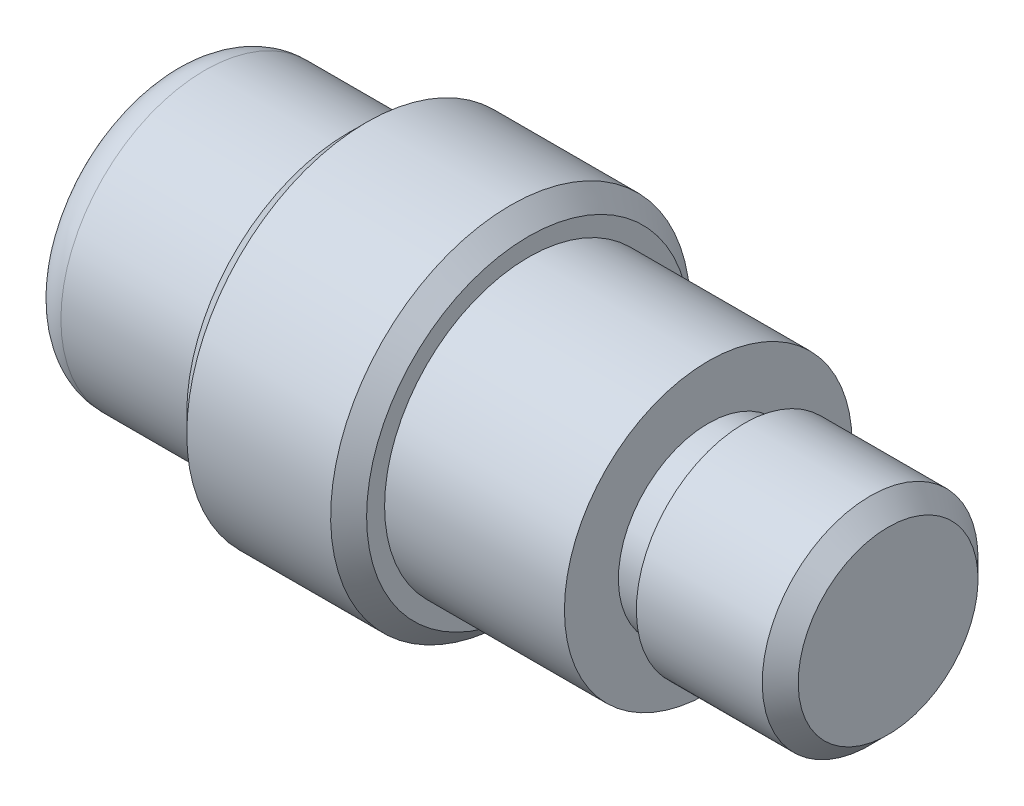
ISO-10303-21;
HEADER;
FILE_DESCRIPTION(('STEP AP214'),'2;1');
FILE_NAME('part.step','',(''),(''),'','','');
FILE_SCHEMA(('AUTOMOTIVE_DESIGN { 1 0 10303 214 1 1 1 1 }'));
ENDSEC;
DATA;
#1=APPLICATION_CONTEXT('core data for automotive mechanical design processes');
#2=APPLICATION_PROTOCOL_DEFINITION('international standard','automotive_design',2000,#1);
#3=PRODUCT_CONTEXT('',#1,'mechanical');
#4=PRODUCT('Part','Part','',(#3));
#5=PRODUCT_RELATED_PRODUCT_CATEGORY('part','',(#4));
#6=PRODUCT_DEFINITION_FORMATION('','',#4);
#7=PRODUCT_DEFINITION_CONTEXT('part definition',#1,'design');
#8=PRODUCT_DEFINITION('design','',#6,#7);
#9=PRODUCT_DEFINITION_SHAPE('','',#8);
#10=(LENGTH_UNIT() NAMED_UNIT(*) SI_UNIT(.MILLI.,.METRE.));
#11=(NAMED_UNIT(*) PLANE_ANGLE_UNIT() SI_UNIT($,.RADIAN.));
#12=(NAMED_UNIT(*) SI_UNIT($,.STERADIAN.) SOLID_ANGLE_UNIT());
#13=UNCERTAINTY_MEASURE_WITH_UNIT(LENGTH_MEASURE(1.E-05),#10,'distance_accuracy_value','');
#14=(GEOMETRIC_REPRESENTATION_CONTEXT(3) GLOBAL_UNCERTAINTY_ASSIGNED_CONTEXT((#13)) GLOBAL_UNIT_ASSIGNED_CONTEXT((#10,
#11,#12)) REPRESENTATION_CONTEXT('',''));
#15=CARTESIAN_POINT('',(0.,0.,0.));
#16=DIRECTION('',(0.,0.,1.));
#17=DIRECTION('',(1.,0.,0.));
#18=AXIS2_PLACEMENT_3D('',#15,#16,#17);
#19=CARTESIAN_POINT('',(-30.,0.,0.));
#20=DIRECTION('',(-1.,0.,0.));
#21=DIRECTION('',(0.,-1.,0.));
#22=AXIS2_PLACEMENT_3D('',#19,#20,#21);
#23=PLANE('',#22);
#24=CARTESIAN_POINT('',(-30.,0.,0.));
#25=DIRECTION('',(-1.,0.,0.));
#26=DIRECTION('',(0.,-1.,0.));
#27=AXIS2_PLACEMENT_3D('',#24,#25,#26);
#28=CIRCLE('',#27,6.);
#29=CARTESIAN_POINT('',(-30.,-6.00000000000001,0.));
#30=VERTEX_POINT('',#29);
#31=EDGE_CURVE('E10',#30,#30,#28,.T.);
#32=ORIENTED_EDGE('',*,*,#31,.T.);
#33=EDGE_LOOP('',(#32));
#34=FACE_BOUND('',#33,.T.);
#35=ADVANCED_FACE('F34',(#34),#23,.T.);
#36=CARTESIAN_POINT('',(38.7898089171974,0.,0.));
#37=DIRECTION('',(1.,0.,0.));
#38=DIRECTION('',(0.,1.,0.));
#39=AXIS2_PLACEMENT_3D('',#36,#37,#38);
#40=CYLINDRICAL_SURFACE('',#39,8.);
#41=CARTESIAN_POINT('',(-28.,0.,0.));
#42=DIRECTION('',(-1.,0.,0.));
#43=DIRECTION('',(0.,-1.,0.));
#44=AXIS2_PLACEMENT_3D('',#41,#42,#43);
#45=CIRCLE('',#44,8.);
#46=CARTESIAN_POINT('',(-28.,-8.00000000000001,0.));
#47=VERTEX_POINT('',#46);
#48=EDGE_CURVE('E41',#47,#47,#45,.F.);
#49=ORIENTED_EDGE('',*,*,#48,.T.);
#50=EDGE_LOOP('',(#49));
#51=FACE_BOUND('',#50,.T.);
#52=CARTESIAN_POINT('',(-20.,0.,0.));
#53=DIRECTION('',(1.,0.,0.));
#54=DIRECTION('',(0.,1.,0.));
#55=AXIS2_PLACEMENT_3D('',#52,#53,#54);
#56=CIRCLE('',#55,8.);
#57=CARTESIAN_POINT('',(-20.,7.99999999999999,0.));
#58=VERTEX_POINT('',#57);
#59=EDGE_CURVE('E66',#58,#58,#56,.T.);
#60=ORIENTED_EDGE('',*,*,#59,.F.);
#61=EDGE_LOOP('',(#60));
#62=FACE_BOUND('',#61,.T.);
#63=ADVANCED_FACE('F103',(#51,#62),#40,.T.);
#64=CARTESIAN_POINT('',(-20.,7.99999999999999,0.));
#65=DIRECTION('',(-1.,0.,0.));
#66=DIRECTION('',(0.,-1.,0.));
#67=AXIS2_PLACEMENT_3D('',#64,#65,#66);
#68=PLANE('',#67);
#69=CARTESIAN_POINT('',(-20.,0.,0.));
#70=DIRECTION('',(-1.,0.,0.));
#71=DIRECTION('',(0.,-1.,0.));
#72=AXIS2_PLACEMENT_3D('',#69,#70,#71);
#73=CIRCLE('',#72,9.);
#74=CARTESIAN_POINT('',(-20.,-9.00000000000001,0.));
#75=VERTEX_POINT('',#74);
#76=EDGE_CURVE('E45',#75,#75,#73,.T.);
#77=ORIENTED_EDGE('',*,*,#76,.T.);
#78=EDGE_LOOP('',(#77));
#79=FACE_BOUND('',#78,.T.);
#80=ORIENTED_EDGE('',*,*,#59,.T.);
#81=EDGE_LOOP('',(#80));
#82=FACE_BOUND('',#81,.T.);
#83=ADVANCED_FACE('F108',(#79,#82),#68,.T.);
#84=CARTESIAN_POINT('',(38.7898089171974,0.,0.));
#85=DIRECTION('',(1.,0.,0.));
#86=DIRECTION('',(0.,1.,0.));
#87=AXIS2_PLACEMENT_3D('',#84,#85,#86);
#88=CYLINDRICAL_SURFACE('',#87,10.);
#89=CARTESIAN_POINT('',(-11.,0.,0.));
#90=DIRECTION('',(1.,0.,0.));
#91=DIRECTION('',(0.,1.,0.));
#92=AXIS2_PLACEMENT_3D('',#89,#90,#91);
#93=CIRCLE('',#92,10.);
#94=CARTESIAN_POINT('',(-11.,9.99999999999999,0.));
#95=VERTEX_POINT('',#94);
#96=EDGE_CURVE('E49',#95,#95,#93,.F.);
#97=ORIENTED_EDGE('',*,*,#96,.T.);
#98=EDGE_LOOP('',(#97));
#99=FACE_BOUND('',#98,.T.);
#100=CARTESIAN_POINT('',(-19.,0.,0.));
#101=DIRECTION('',(-1.,0.,0.));
#102=DIRECTION('',(0.,-1.,0.));
#103=AXIS2_PLACEMENT_3D('',#100,#101,#102);
#104=CIRCLE('',#103,10.);
#105=CARTESIAN_POINT('',(-19.,-10.,0.));
#106=VERTEX_POINT('',#105);
#107=EDGE_CURVE('E54',#106,#106,#104,.F.);
#108=ORIENTED_EDGE('',*,*,#107,.T.);
#109=EDGE_LOOP('',(#108));
#110=FACE_BOUND('',#109,.T.);
#111=ADVANCED_FACE('F130',(#99,#110),#88,.T.);
#112=CARTESIAN_POINT('',(-10.,9.99999999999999,0.));
#113=DIRECTION('',(1.,0.,0.));
#114=DIRECTION('',(0.,1.,0.));
#115=AXIS2_PLACEMENT_3D('',#112,#113,#114);
#116=PLANE('',#115);
#117=CARTESIAN_POINT('',(-9.99999999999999,0.,0.));
#118=DIRECTION('',(1.,0.,0.));
#119=DIRECTION('',(0.,1.,0.));
#120=AXIS2_PLACEMENT_3D('',#117,#118,#119);
#121=CIRCLE('',#120,9.00000000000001);
#122=CARTESIAN_POINT('',(-10.,9.00000000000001,0.));
#123=VERTEX_POINT('',#122);
#124=EDGE_CURVE('E57',#123,#123,#121,.T.);
#125=ORIENTED_EDGE('',*,*,#124,.T.);
#126=EDGE_LOOP('',(#125));
#127=FACE_BOUND('',#126,.T.);
#128=CARTESIAN_POINT('',(-9.99999999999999,0.,0.));
#129=DIRECTION('',(1.,0.,0.));
#130=DIRECTION('',(0.,1.,0.));
#131=AXIS2_PLACEMENT_3D('',#128,#129,#130);
#132=CIRCLE('',#131,8.00000000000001);
#133=CARTESIAN_POINT('',(-10.,8.,0.));
#134=VERTEX_POINT('',#133);
#135=EDGE_CURVE('E69',#134,#134,#132,.T.);
#136=ORIENTED_EDGE('',*,*,#135,.F.);
#137=EDGE_LOOP('',(#136));
#138=FACE_BOUND('',#137,.T.);
#139=ADVANCED_FACE('F132',(#127,#138),#116,.T.);
#140=CARTESIAN_POINT('',(38.7898089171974,0.,0.));
#141=DIRECTION('',(1.,0.,0.));
#142=DIRECTION('',(0.,1.,0.));
#143=AXIS2_PLACEMENT_3D('',#140,#141,#142);
#144=CYLINDRICAL_SURFACE('',#143,8.00000000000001);
#145=ORIENTED_EDGE('',*,*,#135,.T.);
#146=EDGE_LOOP('',(#145));
#147=FACE_BOUND('',#146,.T.);
#148=CARTESIAN_POINT('',(0.,0.,0.));
#149=DIRECTION('',(1.,0.,0.));
#150=DIRECTION('',(0.,1.,0.));
#151=AXIS2_PLACEMENT_3D('',#148,#149,#150);
#152=CIRCLE('',#151,8.00000000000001);
#153=CARTESIAN_POINT('',(0.,8.,0.));
#154=VERTEX_POINT('',#153);
#155=EDGE_CURVE('E72',#154,#154,#152,.T.);
#156=ORIENTED_EDGE('',*,*,#155,.F.);
#157=EDGE_LOOP('',(#156));
#158=FACE_BOUND('',#157,.T.);
#159=ADVANCED_FACE('F139',(#147,#158),#144,.T.);
#160=CARTESIAN_POINT('',(0.,8.,0.));
#161=DIRECTION('',(1.,0.,0.));
#162=DIRECTION('',(0.,1.,0.));
#163=AXIS2_PLACEMENT_3D('',#160,#161,#162);
#164=PLANE('',#163);
#165=ORIENTED_EDGE('',*,*,#155,.T.);
#166=EDGE_LOOP('',(#165));
#167=FACE_BOUND('',#166,.T.);
#168=CARTESIAN_POINT('',(0.,0.,0.));
#169=DIRECTION('',(1.,0.,0.));
#170=DIRECTION('',(0.,1.,0.));
#171=AXIS2_PLACEMENT_3D('',#168,#169,#170);
#172=CIRCLE('',#171,5.);
#173=CARTESIAN_POINT('',(0.,4.99999999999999,0.));
#174=VERTEX_POINT('',#173);
#175=EDGE_CURVE('E75',#174,#174,#172,.T.);
#176=ORIENTED_EDGE('',*,*,#175,.F.);
#177=EDGE_LOOP('',(#176));
#178=FACE_BOUND('',#177,.T.);
#179=ADVANCED_FACE('F99',(#167,#178),#164,.T.);
#180=CARTESIAN_POINT('',(38.7898089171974,0.,0.));
#181=DIRECTION('',(1.,0.,0.));
#182=DIRECTION('',(0.,1.,0.));
#183=AXIS2_PLACEMENT_3D('',#180,#181,#182);
#184=CYLINDRICAL_SURFACE('',#183,5.);
#185=ORIENTED_EDGE('',*,*,#175,.T.);
#186=EDGE_LOOP('',(#185));
#187=FACE_BOUND('',#186,.T.);
#188=CARTESIAN_POINT('',(2.,0.,0.));
#189=DIRECTION('',(1.,0.,0.));
#190=DIRECTION('',(0.,1.,0.));
#191=AXIS2_PLACEMENT_3D('',#188,#189,#190);
#192=CIRCLE('',#191,5.);
#193=CARTESIAN_POINT('',(2.,4.99999999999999,0.));
#194=VERTEX_POINT('',#193);
#195=EDGE_CURVE('E78',#194,#194,#192,.T.);
#196=ORIENTED_EDGE('',*,*,#195,.F.);
#197=EDGE_LOOP('',(#196));
#198=FACE_BOUND('',#197,.T.);
#199=ADVANCED_FACE('F89',(#187,#198),#184,.T.);
#200=CARTESIAN_POINT('',(2.,5.99999999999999,0.));
#201=DIRECTION('',(-1.,0.,0.));
#202=DIRECTION('',(0.,-1.,0.));
#203=AXIS2_PLACEMENT_3D('',#200,#201,#202);
#204=PLANE('',#203);
#205=ORIENTED_EDGE('',*,*,#195,.T.);
#206=EDGE_LOOP('',(#205));
#207=FACE_BOUND('',#206,.T.);
#208=CARTESIAN_POINT('',(2.,0.,0.));
#209=DIRECTION('',(1.,0.,0.));
#210=DIRECTION('',(0.,1.,0.));
#211=AXIS2_PLACEMENT_3D('',#208,#209,#210);
#212=CIRCLE('',#211,6.);
#213=CARTESIAN_POINT('',(2.,5.99999999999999,0.));
#214=VERTEX_POINT('',#213);
#215=EDGE_CURVE('E81',#214,#214,#212,.T.);
#216=ORIENTED_EDGE('',*,*,#215,.F.);
#217=EDGE_LOOP('',(#216));
#218=FACE_BOUND('',#217,.T.);
#219=ADVANCED_FACE('F87',(#207,#218),#204,.T.);
#220=CARTESIAN_POINT('',(38.7898089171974,0.,0.));
#221=DIRECTION('',(1.,0.,0.));
#222=DIRECTION('',(0.,1.,0.));
#223=AXIS2_PLACEMENT_3D('',#220,#221,#222);
#224=CYLINDRICAL_SURFACE('',#223,6.);
#225=CARTESIAN_POINT('',(9.,0.,0.));
#226=DIRECTION('',(1.,0.,0.));
#227=DIRECTION('',(0.,1.,0.));
#228=AXIS2_PLACEMENT_3D('',#225,#226,#227);
#229=CIRCLE('',#228,6.);
#230=CARTESIAN_POINT('',(9.,5.99999999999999,0.));
#231=VERTEX_POINT('',#230);
#232=EDGE_CURVE('E60',#231,#231,#229,.F.);
#233=ORIENTED_EDGE('',*,*,#232,.T.);
#234=EDGE_LOOP('',(#233));
#235=FACE_BOUND('',#234,.T.);
#236=ORIENTED_EDGE('',*,*,#215,.T.);
#237=EDGE_LOOP('',(#236));
#238=FACE_BOUND('',#237,.T.);
#239=ADVANCED_FACE('F85',(#235,#238),#224,.T.);
#240=CARTESIAN_POINT('',(10.,5.99999999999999,0.));
#241=DIRECTION('',(1.,0.,0.));
#242=DIRECTION('',(0.,1.,0.));
#243=AXIS2_PLACEMENT_3D('',#240,#241,#242);
#244=PLANE('',#243);
#245=CARTESIAN_POINT('',(10.,0.,0.));
#246=DIRECTION('',(1.,0.,0.));
#247=DIRECTION('',(0.,1.,0.));
#248=AXIS2_PLACEMENT_3D('',#245,#246,#247);
#249=CIRCLE('',#248,5.);
#250=CARTESIAN_POINT('',(10.,5.,0.));
#251=VERTEX_POINT('',#250);
#252=EDGE_CURVE('E63',#251,#251,#249,.T.);
#253=ORIENTED_EDGE('',*,*,#252,.T.);
#254=EDGE_LOOP('',(#253));
#255=FACE_BOUND('',#254,.T.);
#256=ADVANCED_FACE('F96',(#255),#244,.T.);
#257=CARTESIAN_POINT('',(10.,0.,0.));
#258=DIRECTION('',(-1.,0.,0.));
#259=DIRECTION('',(0.,-1.,0.));
#260=AXIS2_PLACEMENT_3D('',#257,#258,#259);
#261=CONICAL_SURFACE('',#260,5.,0.785398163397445);
#262=ORIENTED_EDGE('',*,*,#232,.F.);
#263=EDGE_LOOP('',(#262));
#264=FACE_BOUND('',#263,.T.);
#265=ORIENTED_EDGE('',*,*,#252,.F.);
#266=EDGE_LOOP('',(#265));
#267=FACE_BOUND('',#266,.T.);
#268=ADVANCED_FACE('F112',(#264,#267),#261,.T.);
#269=CARTESIAN_POINT('',(-9.99999999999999,0.,0.));
#270=DIRECTION('',(-1.,0.,0.));
#271=DIRECTION('',(0.,-1.,0.));
#272=AXIS2_PLACEMENT_3D('',#269,#270,#271);
#273=CONICAL_SURFACE('',#272,9.00000000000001,0.785398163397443);
#274=ORIENTED_EDGE('',*,*,#96,.F.);
#275=EDGE_LOOP('',(#274));
#276=FACE_BOUND('',#275,.T.);
#277=ORIENTED_EDGE('',*,*,#124,.F.);
#278=EDGE_LOOP('',(#277));
#279=FACE_BOUND('',#278,.T.);
#280=ADVANCED_FACE('F115',(#276,#279),#273,.T.);
#281=CARTESIAN_POINT('',(-19.,0.,0.));
#282=DIRECTION('',(1.,0.,0.));
#283=DIRECTION('',(0.,1.,0.));
#284=AXIS2_PLACEMENT_3D('',#281,#282,#283);
#285=CONICAL_SURFACE('',#284,10.,0.785398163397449);
#286=ORIENTED_EDGE('',*,*,#76,.F.);
#287=EDGE_LOOP('',(#286));
#288=FACE_BOUND('',#287,.T.);
#289=ORIENTED_EDGE('',*,*,#107,.F.);
#290=EDGE_LOOP('',(#289));
#291=FACE_BOUND('',#290,.T.);
#292=ADVANCED_FACE('F118',(#288,#291),#285,.T.);
#293=CARTESIAN_POINT('',(-28.,0.,0.));
#294=DIRECTION('',(-1.,0.,0.));
#295=DIRECTION('',(0.,-1.,0.));
#296=AXIS2_PLACEMENT_3D('',#293,#294,#295);
#297=TOROIDAL_SURFACE('',#296,6.,2.);
#298=ORIENTED_EDGE('',*,*,#31,.F.);
#299=EDGE_LOOP('',(#298));
#300=FACE_BOUND('',#299,.T.);
#301=ORIENTED_EDGE('',*,*,#48,.F.);
#302=EDGE_LOOP('',(#301));
#303=FACE_BOUND('',#302,.T.);
#304=ADVANCED_FACE('F36',(#300,#303),#297,.T.);
#305=CLOSED_SHELL('',(#35,#63,#83,#111,#139,#159,#179,#199,#219,#239,#256,#268,#280,#292,#304));
#306=MANIFOLD_SOLID_BREP('B2',#305);
#307=ADVANCED_BREP_SHAPE_REPRESENTATION('',(#18,#306),#14);
#308=SHAPE_DEFINITION_REPRESENTATION(#9,#307);
ENDSEC;
END-ISO-10303-21;
